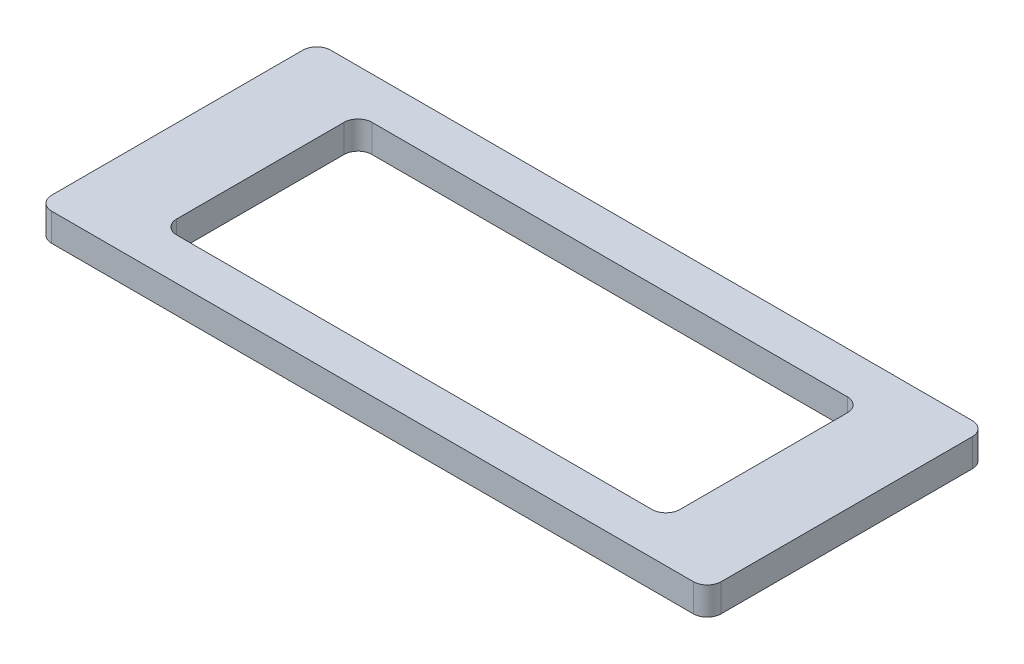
from build123d import *

# Parameters (mm, degrees)
EXTRUDE1_DEPTH     = 6.35
SKETCH2_R          = 1.651
CUT_EXTRUDE1_DEPTH = 1.5875


with BuildPart() as part:
    # Sketch1 → Extrude1 (new body)
    with BuildSketch(Plane(origin=(0, 0, 0), x_dir=(1, 0, 0), z_dir=(0, 1, 0))):
        with BuildLine():
            Line((120.904, 53.975), (-6.35, 53.975))
            Line((-6.35, 53.975), (-15.748, 53.975))
            ThreePointArc((-15.748, 53.975), (-17.99306403, 53.04506403), (-18.923, 50.8))
            Line((-18.923, 50.8), (-18.923, -6.35))
            ThreePointArc((-18.923, -6.35), (-17.99306403, -8.59506403), (-15.748, -9.525))
            Line((-15.748, -9.525), (-6.35, -9.525))
            Line((-6.35, -9.525), (120.904, -9.525))
            Line((120.904, -9.525), (130.302, -9.525))
            ThreePointArc((130.302, -9.525), (132.54706403, -8.59506403), (133.477, -6.35))
            Line((133.477, -6.35), (133.477, 50.8))
            ThreePointArc((133.477, 50.8), (132.54706403, 53.04506403), (130.302, 53.975))
            Line((130.302, 53.975), (120.904, 53.975))
        make_face()
        with BuildLine():
            Line((111.379, 0), (3.175, 0))
            ThreePointArc((3.175, 0), (0.92993597, 0.92993597), (0, 3.175))
            Line((0, 3.175), (0, 41.275))
            ThreePointArc((0, 41.275), (0.92993597, 43.52006403), (3.175, 44.45))
            Line((3.175, 44.45), (111.379, 44.45))
            ThreePointArc((111.379, 44.45), (113.62406403, 43.52006403), (114.554, 41.275))
            Line((114.554, 41.275), (114.554, 3.175))
            ThreePointArc((114.554, 3.175), (113.62406403, 0.92993597), (111.379, 0))
        make_face(mode=Mode.SUBTRACT)
    extrude(amount=EXTRUDE1_DEPTH)

    # Sketch2 → Cut-Extrude1 (cut)
    with BuildSketch(Plane.XZ):
        with Locations(Location((103.123327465, -47.625, 0), (0, 0, 270))):
            Circle(SKETCH2_R)
        with Locations(Location((57.403327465, -47.625, 0), (0, 0, 270))):
            Circle(SKETCH2_R)
        with Locations(Location((11.683327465, -47.625, 0), (0, 0, 270))):
            Circle(SKETCH2_R)
        with Locations(Location((103.123327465, 3.175, 0), (0, 0, 270))):
            Circle(SKETCH2_R)
        with Locations(Location((57.403327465, 3.175, 0), (0, 0, 270))):
            Circle(SKETCH2_R)
        with Locations(Location((11.683327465, 3.175, 0), (0, 0, 270))):
            Circle(SKETCH2_R)
    extrude(amount=-CUT_EXTRUDE1_DEPTH, mode=Mode.SUBTRACT)


solid = part.part
